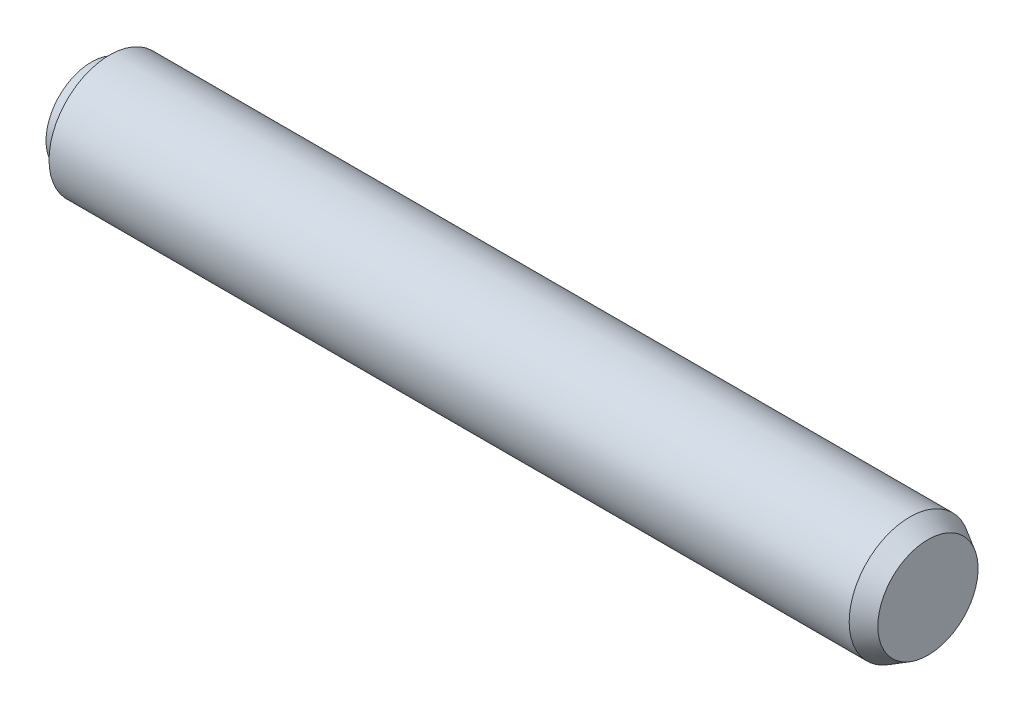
from build123d import *

# Parameters (mm, degrees)
CHANFREIN1_SIZE  = 3
CHANFREIN1_SIZE2 = 1.732050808


with BuildPart() as part:
    # Esquisse1 → R_volution1 (revolve)
    with BuildSketch(Plane.XY, mode=Mode.PRIVATE) as r_volution1_sk:
        Polygon((0, 0), (0, 7.5), (3, 7.5), (3, 10), (138, 10), (138, 0), align=None)
    revolve(r_volution1_sk.sketch.rotate(Axis((0, 0, 0), (1, 0, 0)), 90), axis=Axis((0, 0, 0), (1, 0, 0)))

    # Chanfrein1
    chanfrein1_edges = [part.edges().sort_by_distance(p)[0] for p in [
        (138, 0, -10),
    ]]
    chanfrein1_side = [part.faces().sort_by_distance(p)[0] for p in [
        (70.5, 0, -10),
    ]]
    chamfer(chanfrein1_edges, length=CHANFREIN1_SIZE, length2=CHANFREIN1_SIZE2, reference=chanfrein1_side[0])


solid = part.part
